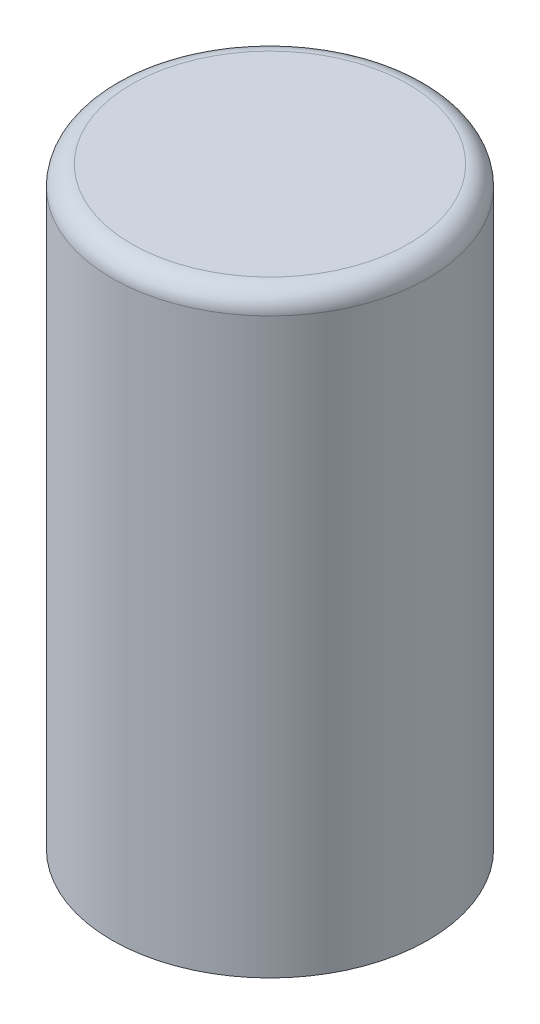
from build123d import *

# Parameters (mm, degrees)
SKETCH1_R           = 4
BOSS_EXTRUDE1_DEPTH = 15
FILLET1_R           = 0.5


with BuildPart() as part:
    # Sketch1 → Boss-Extrude1 (new body)
    with BuildSketch(Plane(origin=(0, 0, 0), x_dir=(1, 0, 0), z_dir=(0, 1, 0))):
        with Locations(Location((0, 0, 0), (0, 0, 270))):
            Circle(SKETCH1_R)
    extrude(amount=BOSS_EXTRUDE1_DEPTH)

    # Fillet1
    fillet1_edges = [part.edges().sort_by_distance(p)[0] for p in [
        (0, 15, -4),
    ]]
    fillet(fillet1_edges, radius=FILLET1_R)


solid = part.part
